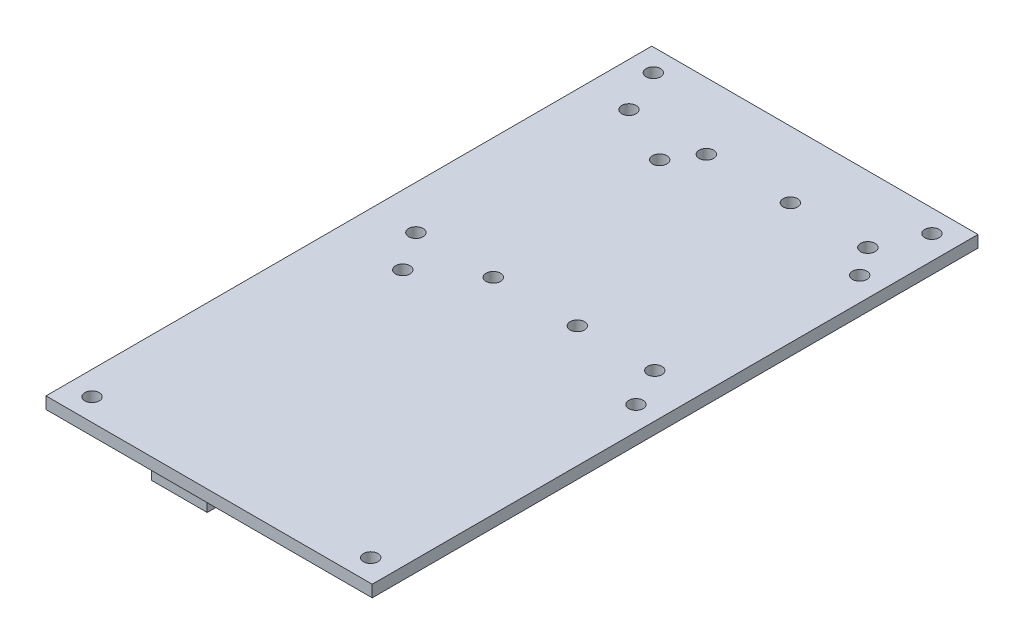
ISO-10303-21;
HEADER;
FILE_DESCRIPTION(('STEP AP214'),'2;1');
FILE_NAME('part.step','',(''),(''),'','','');
FILE_SCHEMA(('AUTOMOTIVE_DESIGN { 1 0 10303 214 1 1 1 1 }'));
ENDSEC;
DATA;
#1=APPLICATION_CONTEXT('core data for automotive mechanical design processes');
#2=APPLICATION_PROTOCOL_DEFINITION('international standard','automotive_design',2000,#1);
#3=PRODUCT_CONTEXT('',#1,'mechanical');
#4=PRODUCT('Part','Part','',(#3));
#5=PRODUCT_RELATED_PRODUCT_CATEGORY('part','',(#4));
#6=PRODUCT_DEFINITION_FORMATION('','',#4);
#7=PRODUCT_DEFINITION_CONTEXT('part definition',#1,'design');
#8=PRODUCT_DEFINITION('design','',#6,#7);
#9=PRODUCT_DEFINITION_SHAPE('','',#8);
#10=(LENGTH_UNIT() NAMED_UNIT(*) SI_UNIT(.MILLI.,.METRE.));
#11=(NAMED_UNIT(*) PLANE_ANGLE_UNIT() SI_UNIT($,.RADIAN.));
#12=(NAMED_UNIT(*) SI_UNIT($,.STERADIAN.) SOLID_ANGLE_UNIT());
#13=UNCERTAINTY_MEASURE_WITH_UNIT(LENGTH_MEASURE(1.E-05),#10,'distance_accuracy_value','');
#14=(GEOMETRIC_REPRESENTATION_CONTEXT(3) GLOBAL_UNCERTAINTY_ASSIGNED_CONTEXT((#13)) GLOBAL_UNIT_ASSIGNED_CONTEXT((#10,
#11,#12)) REPRESENTATION_CONTEXT('',''));
#15=CARTESIAN_POINT('',(0.,0.,0.));
#16=DIRECTION('',(0.,0.,1.));
#17=DIRECTION('',(1.,0.,0.));
#18=AXIS2_PLACEMENT_3D('',#15,#16,#17);
#19=CARTESIAN_POINT('',(0.,0.,0.));
#20=DIRECTION('',(0.,-1.,0.));
#21=DIRECTION('',(0.,0.,-1.));
#22=AXIS2_PLACEMENT_3D('',#19,#20,#21);
#23=PLANE('',#22);
#24=CARTESIAN_POINT('',(14.859,0.,-61.7062000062));
#25=DIRECTION('',(0.,1.,0.));
#26=DIRECTION('',(0.,0.,1.));
#27=AXIS2_PLACEMENT_3D('',#24,#25,#26);
#28=CIRCLE('',#27,1.5499969);
#29=CARTESIAN_POINT('',(14.859,0.,-60.1562031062));
#30=VERTEX_POINT('',#29);
#31=EDGE_CURVE('E220',#30,#30,#28,.T.);
#32=ORIENTED_EDGE('',*,*,#31,.T.);
#33=EDGE_LOOP('',(#32));
#34=FACE_BOUND('',#33,.T.);
#35=CARTESIAN_POINT('',(64.897,0.,-61.7062000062));
#36=DIRECTION('',(0.,1.,0.));
#37=DIRECTION('',(0.,0.,1.));
#38=AXIS2_PLACEMENT_3D('',#35,#36,#37);
#39=CIRCLE('',#38,1.5499969);
#40=CARTESIAN_POINT('',(64.897,0.,-60.1562031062));
#41=VERTEX_POINT('',#40);
#42=EDGE_CURVE('E212',#41,#41,#39,.T.);
#43=ORIENTED_EDGE('',*,*,#42,.T.);
#44=EDGE_LOOP('',(#43));
#45=FACE_BOUND('',#44,.T.);
#46=CARTESIAN_POINT('',(64.897,0.,-109.7122000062));
#47=DIRECTION('',(0.,1.,0.));
#48=DIRECTION('',(0.,0.,1.));
#49=AXIS2_PLACEMENT_3D('',#46,#47,#48);
#50=CIRCLE('',#49,1.5499969);
#51=CARTESIAN_POINT('',(64.897,0.,-108.1622031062));
#52=VERTEX_POINT('',#51);
#53=EDGE_CURVE('E203',#52,#52,#50,.T.);
#54=ORIENTED_EDGE('',*,*,#53,.T.);
#55=EDGE_LOOP('',(#54));
#56=FACE_BOUND('',#55,.T.);
#57=CARTESIAN_POINT('',(21.971,0.,-109.7122000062));
#58=DIRECTION('',(0.,1.,0.));
#59=DIRECTION('',(0.,0.,1.));
#60=AXIS2_PLACEMENT_3D('',#57,#58,#59);
#61=CIRCLE('',#60,1.5499969);
#62=CARTESIAN_POINT('',(21.971,0.,-108.1622031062));
#63=VERTEX_POINT('',#62);
#64=EDGE_CURVE('E227',#63,#63,#61,.T.);
#65=ORIENTED_EDGE('',*,*,#64,.T.);
#66=EDGE_LOOP('',(#65));
#67=FACE_BOUND('',#66,.T.);
#68=CARTESIAN_POINT('',(9.34800010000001,0.,-70.0281999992));
#69=DIRECTION('',(0.,1.,0.));
#70=DIRECTION('',(0.,0.,1.));
#71=AXIS2_PLACEMENT_3D('',#68,#69,#70);
#72=CIRCLE('',#71,1.54999689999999);
#73=CARTESIAN_POINT('',(9.34800010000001,0.,-68.4782030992));
#74=VERTEX_POINT('',#73);
#75=EDGE_CURVE('E259',#74,#74,#72,.T.);
#76=ORIENTED_EDGE('',*,*,#75,.T.);
#77=EDGE_LOOP('',(#76));
#78=FACE_BOUND('',#77,.T.);
#79=CARTESIAN_POINT('',(25.9596001,0.,-70.0281999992));
#80=DIRECTION('',(0.,1.,0.));
#81=DIRECTION('',(0.,0.,1.));
#82=AXIS2_PLACEMENT_3D('',#79,#80,#81);
#83=CIRCLE('',#82,1.5499969);
#84=CARTESIAN_POINT('',(25.9596001,0.,-68.4782030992));
#85=VERTEX_POINT('',#84);
#86=EDGE_CURVE('E268',#85,#85,#83,.T.);
#87=ORIENTED_EDGE('',*,*,#86,.T.);
#88=EDGE_LOOP('',(#87));
#89=FACE_BOUND('',#88,.T.);
#90=CARTESIAN_POINT('',(25.9596001,0.,-115.7481999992));
#91=DIRECTION('',(0.,1.,0.));
#92=DIRECTION('',(0.,0.,1.));
#93=AXIS2_PLACEMENT_3D('',#90,#91,#92);
#94=CIRCLE('',#93,1.5499969);
#95=CARTESIAN_POINT('',(25.9596001,0.,-114.1982030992));
#96=VERTEX_POINT('',#95);
#97=EDGE_CURVE('E276',#96,#96,#94,.T.);
#98=ORIENTED_EDGE('',*,*,#97,.T.);
#99=EDGE_LOOP('',(#98));
#100=FACE_BOUND('',#99,.T.);
#101=CARTESIAN_POINT('',(43.9928,0.,-115.7481999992));
#102=DIRECTION('',(0.,1.,0.));
#103=DIRECTION('',(0.,0.,1.));
#104=AXIS2_PLACEMENT_3D('',#101,#102,#103);
#105=CIRCLE('',#104,1.54999689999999);
#106=CARTESIAN_POINT('',(43.9928,0.,-114.1982030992));
#107=VERTEX_POINT('',#106);
#108=EDGE_CURVE('E284',#107,#107,#105,.T.);
#109=ORIENTED_EDGE('',*,*,#108,.T.);
#110=EDGE_LOOP('',(#109));
#111=FACE_BOUND('',#110,.T.);
#112=CARTESIAN_POINT('',(60.6044,0.,-115.7481999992));
#113=DIRECTION('',(0.,1.,0.));
#114=DIRECTION('',(0.,0.,1.));
#115=AXIS2_PLACEMENT_3D('',#112,#113,#114);
#116=CIRCLE('',#115,1.5499969);
#117=CARTESIAN_POINT('',(60.6044,0.,-114.1982030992));
#118=VERTEX_POINT('',#117);
#119=EDGE_CURVE('E235',#118,#118,#116,.T.);
#120=ORIENTED_EDGE('',*,*,#119,.T.);
#121=EDGE_LOOP('',(#120));
#122=FACE_BOUND('',#121,.T.);
#123=CARTESIAN_POINT('',(60.6044,0.,-70.0281999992));
#124=DIRECTION('',(0.,1.,0.));
#125=DIRECTION('',(0.,0.,1.));
#126=AXIS2_PLACEMENT_3D('',#123,#124,#125);
#127=CIRCLE('',#126,1.5499969);
#128=CARTESIAN_POINT('',(60.6044,0.,-68.4782030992));
#129=VERTEX_POINT('',#128);
#130=EDGE_CURVE('E244',#129,#129,#127,.T.);
#131=ORIENTED_EDGE('',*,*,#130,.T.);
#132=EDGE_LOOP('',(#131));
#133=FACE_BOUND('',#132,.T.);
#134=CARTESIAN_POINT('',(43.9928,0.,-70.0281999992));
#135=DIRECTION('',(0.,1.,0.));
#136=DIRECTION('',(0.,0.,1.));
#137=AXIS2_PLACEMENT_3D('',#134,#135,#136);
#138=CIRCLE('',#137,1.54999689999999);
#139=CARTESIAN_POINT('',(43.9928,0.,-68.4782030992));
#140=VERTEX_POINT('',#139);
#141=EDGE_CURVE('E252',#140,#140,#138,.T.);
#142=ORIENTED_EDGE('',*,*,#141,.T.);
#143=EDGE_LOOP('',(#142));
#144=FACE_BOUND('',#143,.T.);
#145=CARTESIAN_POINT('',(9.3480001,0.,-115.7481999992));
#146=DIRECTION('',(0.,1.,0.));
#147=DIRECTION('',(0.,0.,1.));
#148=AXIS2_PLACEMENT_3D('',#145,#146,#147);
#149=CIRCLE('',#148,1.54999689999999);
#150=CARTESIAN_POINT('',(9.3480001,0.,-114.1982030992));
#151=VERTEX_POINT('',#150);
#152=EDGE_CURVE('E291',#151,#151,#149,.T.);
#153=ORIENTED_EDGE('',*,*,#152,.T.);
#154=EDGE_LOOP('',(#153));
#155=FACE_BOUND('',#154,.T.);
#156=CARTESIAN_POINT('',(5.1054,0.,-4.7752));
#157=DIRECTION('',(0.,1.,0.));
#158=DIRECTION('',(0.,0.,1.));
#159=AXIS2_PLACEMENT_3D('',#156,#157,#158);
#160=CIRCLE('',#159,1.5499969);
#161=CARTESIAN_POINT('',(5.1054,0.,-3.2252031));
#162=VERTEX_POINT('',#161);
#163=EDGE_CURVE('E316',#162,#162,#160,.T.);
#164=ORIENTED_EDGE('',*,*,#163,.T.);
#165=EDGE_LOOP('',(#164));
#166=FACE_BOUND('',#165,.T.);
#167=CARTESIAN_POINT('',(64.897,0.,-4.7752));
#168=DIRECTION('',(0.,1.,0.));
#169=DIRECTION('',(0.,0.,1.));
#170=AXIS2_PLACEMENT_3D('',#167,#168,#169);
#171=CIRCLE('',#170,1.5499969);
#172=CARTESIAN_POINT('',(64.897,0.,-3.2252031));
#173=VERTEX_POINT('',#172);
#174=EDGE_CURVE('E308',#173,#173,#171,.T.);
#175=ORIENTED_EDGE('',*,*,#174,.T.);
#176=EDGE_LOOP('',(#175));
#177=FACE_BOUND('',#176,.T.);
#178=CARTESIAN_POINT('',(64.897,0.,-125.222));
#179=DIRECTION('',(0.,1.,0.));
#180=DIRECTION('',(0.,0.,1.));
#181=AXIS2_PLACEMENT_3D('',#178,#179,#180);
#182=CIRCLE('',#181,1.54999690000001);
#183=CARTESIAN_POINT('',(64.897,0.,-123.6720031));
#184=VERTEX_POINT('',#183);
#185=EDGE_CURVE('E299',#184,#184,#182,.T.);
#186=ORIENTED_EDGE('',*,*,#185,.T.);
#187=EDGE_LOOP('',(#186));
#188=FACE_BOUND('',#187,.T.);
#189=CARTESIAN_POINT('',(5.10539999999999,0.,-125.222));
#190=DIRECTION('',(0.,1.,0.));
#191=DIRECTION('',(0.,0.,1.));
#192=AXIS2_PLACEMENT_3D('',#189,#190,#191);
#193=CIRCLE('',#192,1.5499969);
#194=CARTESIAN_POINT('',(5.10539999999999,0.,-123.6720031));
#195=VERTEX_POINT('',#194);
#196=EDGE_CURVE('E323',#195,#195,#193,.T.);
#197=ORIENTED_EDGE('',*,*,#196,.T.);
#198=EDGE_LOOP('',(#197));
#199=FACE_BOUND('',#198,.T.);
#200=DIRECTION('',(0.,0.,1.));
#201=VECTOR('',#200,1.);
#202=CARTESIAN_POINT('',(0.,0.,0.));
#203=LINE('',#202,#201);
#204=CARTESIAN_POINT('',(0.,0.,-129.9972));
#205=VERTEX_POINT('',#204);
#206=CARTESIAN_POINT('',(0.,0.,0.));
#207=VERTEX_POINT('',#206);
#208=EDGE_CURVE('E327',#205,#207,#203,.T.);
#209=ORIENTED_EDGE('',*,*,#208,.F.);
#210=DIRECTION('',(-1.,0.,0.));
#211=VECTOR('',#210,1.);
#212=CARTESIAN_POINT('',(0.,0.,-129.9972));
#213=LINE('',#212,#211);
#214=CARTESIAN_POINT('',(70.0024,0.,-129.9972));
#215=VERTEX_POINT('',#214);
#216=EDGE_CURVE('E336',#215,#205,#213,.T.);
#217=ORIENTED_EDGE('',*,*,#216,.F.);
#218=DIRECTION('',(0.,0.,-1.));
#219=VECTOR('',#218,1.);
#220=CARTESIAN_POINT('',(70.0024,0.,0.));
#221=LINE('',#220,#219);
#222=CARTESIAN_POINT('',(70.0024,0.,0.));
#223=VERTEX_POINT('',#222);
#224=EDGE_CURVE('E352',#223,#215,#221,.T.);
#225=ORIENTED_EDGE('',*,*,#224,.F.);
#226=DIRECTION('',(1.,0.,0.));
#227=VECTOR('',#226,1.);
#228=CARTESIAN_POINT('',(0.,0.,0.));
#229=LINE('',#228,#227);
#230=EDGE_CURVE('E349',#207,#223,#229,.T.);
#231=ORIENTED_EDGE('',*,*,#230,.F.);
#232=EDGE_LOOP('',(#209,#217,#225,#231));
#233=FACE_BOUND('',#232,.T.);
#234=DIRECTION('',(1.,0.,0.));
#235=VECTOR('',#234,1.);
#236=CARTESIAN_POINT('',(18.4380000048,0.,-18.209999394));
#237=LINE('',#236,#235);
#238=CARTESIAN_POINT('',(18.4380000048,0.,-18.209999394));
#239=VERTEX_POINT('',#238);
#240=CARTESIAN_POINT('',(30.4380014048,0.,-18.209999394));
#241=VERTEX_POINT('',#240);
#242=EDGE_CURVE('E163',#239,#241,#237,.T.);
#243=ORIENTED_EDGE('',*,*,#242,.F.);
#244=DIRECTION('',(0.,0.,-1.));
#245=VECTOR('',#244,1.);
#246=CARTESIAN_POINT('',(18.4380000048,0.,-4.1599993));
#247=LINE('',#246,#245);
#248=CARTESIAN_POINT('',(18.4380000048,0.,-4.1599993));
#249=VERTEX_POINT('',#248);
#250=EDGE_CURVE('E158',#249,#239,#247,.T.);
#251=ORIENTED_EDGE('',*,*,#250,.F.);
#252=DIRECTION('',(-1.,0.,0.));
#253=VECTOR('',#252,1.);
#254=CARTESIAN_POINT('',(18.4380000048,0.,-4.1599993));
#255=LINE('',#254,#253);
#256=CARTESIAN_POINT('',(30.4380014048,0.,-4.1599993));
#257=VERTEX_POINT('',#256);
#258=EDGE_CURVE('E173',#257,#249,#255,.T.);
#259=ORIENTED_EDGE('',*,*,#258,.F.);
#260=DIRECTION('',(0.,0.,1.));
#261=VECTOR('',#260,1.);
#262=CARTESIAN_POINT('',(30.4380014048,0.,-4.1599993));
#263=LINE('',#262,#261);
#264=EDGE_CURVE('E185',#241,#257,#263,.T.);
#265=ORIENTED_EDGE('',*,*,#264,.F.);
#266=EDGE_LOOP('',(#243,#251,#259,#265));
#267=FACE_BOUND('',#266,.T.);
#268=DIRECTION('',(1.,0.,0.));
#269=VECTOR('',#268,1.);
#270=CARTESIAN_POINT('',(28.956,0.,-127.9692000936));
#271=LINE('',#270,#269);
#272=CARTESIAN_POINT('',(28.956,0.,-127.9692000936));
#273=VERTEX_POINT('',#272);
#274=CARTESIAN_POINT('',(40.9560014,0.,-127.9692000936));
#275=VERTEX_POINT('',#274);
#276=EDGE_CURVE('E754',#273,#275,#271,.T.);
#277=ORIENTED_EDGE('',*,*,#276,.F.);
#278=DIRECTION('',(0.,0.,-1.));
#279=VECTOR('',#278,1.);
#280=CARTESIAN_POINT('',(28.956,0.,-113.9191999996));
#281=LINE('',#280,#279);
#282=CARTESIAN_POINT('',(28.956,0.,-113.9191999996));
#283=VERTEX_POINT('',#282);
#284=EDGE_CURVE('E155',#283,#273,#281,.T.);
#285=ORIENTED_EDGE('',*,*,#284,.F.);
#286=DIRECTION('',(-1.,0.,0.));
#287=VECTOR('',#286,1.);
#288=CARTESIAN_POINT('',(28.956,0.,-113.9191999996));
#289=LINE('',#288,#287);
#290=CARTESIAN_POINT('',(40.9560014,0.,-113.9191999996));
#291=VERTEX_POINT('',#290);
#292=EDGE_CURVE('E151',#291,#283,#289,.T.);
#293=ORIENTED_EDGE('',*,*,#292,.F.);
#294=DIRECTION('',(0.,0.,1.));
#295=VECTOR('',#294,1.);
#296=CARTESIAN_POINT('',(40.9560014,0.,-113.9191999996));
#297=LINE('',#296,#295);
#298=EDGE_CURVE('E750',#275,#291,#297,.T.);
#299=ORIENTED_EDGE('',*,*,#298,.F.);
#300=EDGE_LOOP('',(#277,#285,#293,#299));
#301=FACE_BOUND('',#300,.T.);
#302=ADVANCED_FACE('F39',(#34,#45,#56,#67,#78,#89,#100,#111,#122,#133,#144,#155,#166,#177,#188,
#199,#233,#267,#301),#23,.T.);
#303=CARTESIAN_POINT('',(0.,2.54,0.));
#304=DIRECTION('',(1.,0.,0.));
#305=DIRECTION('',(0.,0.,-1.));
#306=AXIS2_PLACEMENT_3D('',#303,#304,#305);
#307=PLANE('',#306);
#308=ORIENTED_EDGE('',*,*,#208,.T.);
#309=DIRECTION('',(0.,-1.,0.));
#310=VECTOR('',#309,1.);
#311=CARTESIAN_POINT('',(0.,2.54,0.));
#312=LINE('',#311,#310);
#313=CARTESIAN_POINT('',(0.,2.54,0.));
#314=VERTEX_POINT('',#313);
#315=EDGE_CURVE('E11',#314,#207,#312,.T.);
#316=ORIENTED_EDGE('',*,*,#315,.F.);
#317=DIRECTION('',(0.,0.,1.));
#318=VECTOR('',#317,1.);
#319=CARTESIAN_POINT('',(0.,2.54,0.));
#320=LINE('',#319,#318);
#321=CARTESIAN_POINT('',(0.,2.54,-129.9972));
#322=VERTEX_POINT('',#321);
#323=EDGE_CURVE('E331',#322,#314,#320,.T.);
#324=ORIENTED_EDGE('',*,*,#323,.F.);
#325=DIRECTION('',(0.,-1.,0.));
#326=VECTOR('',#325,1.);
#327=CARTESIAN_POINT('',(0.,2.54,-129.9972));
#328=LINE('',#327,#326);
#329=EDGE_CURVE('E345',#322,#205,#328,.T.);
#330=ORIENTED_EDGE('',*,*,#329,.T.);
#331=EDGE_LOOP('',(#308,#316,#324,#330));
#332=FACE_BOUND('',#331,.T.);
#333=ADVANCED_FACE('F41',(#332),#307,.F.);
#334=CARTESIAN_POINT('',(0.,2.54,0.));
#335=DIRECTION('',(0.,0.,-1.));
#336=DIRECTION('',(-1.,0.,0.));
#337=AXIS2_PLACEMENT_3D('',#334,#335,#336);
#338=PLANE('',#337);
#339=ORIENTED_EDGE('',*,*,#230,.T.);
#340=DIRECTION('',(0.,-1.,0.));
#341=VECTOR('',#340,1.);
#342=CARTESIAN_POINT('',(70.0024,2.54,0.));
#343=LINE('',#342,#341);
#344=CARTESIAN_POINT('',(70.0024,2.54,0.));
#345=VERTEX_POINT('',#344);
#346=EDGE_CURVE('E48',#345,#223,#343,.T.);
#347=ORIENTED_EDGE('',*,*,#346,.F.);
#348=DIRECTION('',(1.,0.,0.));
#349=VECTOR('',#348,1.);
#350=CARTESIAN_POINT('',(0.,2.54,0.));
#351=LINE('',#350,#349);
#352=EDGE_CURVE('E335',#314,#345,#351,.T.);
#353=ORIENTED_EDGE('',*,*,#352,.F.);
#354=ORIENTED_EDGE('',*,*,#315,.T.);
#355=EDGE_LOOP('',(#339,#347,#353,#354));
#356=FACE_BOUND('',#355,.T.);
#357=ADVANCED_FACE('F385',(#356),#338,.F.);
#358=CARTESIAN_POINT('',(70.0024,2.54,0.));
#359=DIRECTION('',(-1.,0.,0.));
#360=DIRECTION('',(0.,0.,1.));
#361=AXIS2_PLACEMENT_3D('',#358,#359,#360);
#362=PLANE('',#361);
#363=ORIENTED_EDGE('',*,*,#224,.T.);
#364=DIRECTION('',(0.,-1.,0.));
#365=VECTOR('',#364,1.);
#366=CARTESIAN_POINT('',(70.0024,2.54,-129.9972));
#367=LINE('',#366,#365);
#368=CARTESIAN_POINT('',(70.0024,2.54,-129.9972));
#369=VERTEX_POINT('',#368);
#370=EDGE_CURVE('E360',#369,#215,#367,.T.);
#371=ORIENTED_EDGE('',*,*,#370,.F.);
#372=DIRECTION('',(0.,0.,-1.));
#373=VECTOR('',#372,1.);
#374=CARTESIAN_POINT('',(70.0024,2.54,0.));
#375=LINE('',#374,#373);
#376=EDGE_CURVE('E339',#345,#369,#375,.T.);
#377=ORIENTED_EDGE('',*,*,#376,.F.);
#378=ORIENTED_EDGE('',*,*,#346,.T.);
#379=EDGE_LOOP('',(#363,#371,#377,#378));
#380=FACE_BOUND('',#379,.T.);
#381=ADVANCED_FACE('F369',(#380),#362,.F.);
#382=CARTESIAN_POINT('',(0.,2.54,-129.9972));
#383=DIRECTION('',(0.,0.,1.));
#384=DIRECTION('',(1.,0.,0.));
#385=AXIS2_PLACEMENT_3D('',#382,#383,#384);
#386=PLANE('',#385);
#387=ORIENTED_EDGE('',*,*,#216,.T.);
#388=ORIENTED_EDGE('',*,*,#329,.F.);
#389=DIRECTION('',(-1.,0.,0.));
#390=VECTOR('',#389,1.);
#391=CARTESIAN_POINT('',(0.,2.54,-129.9972));
#392=LINE('',#391,#390);
#393=EDGE_CURVE('E342',#369,#322,#392,.T.);
#394=ORIENTED_EDGE('',*,*,#393,.F.);
#395=ORIENTED_EDGE('',*,*,#370,.T.);
#396=EDGE_LOOP('',(#387,#388,#394,#395));
#397=FACE_BOUND('',#396,.T.);
#398=ADVANCED_FACE('F378',(#397),#386,.F.);
#399=CARTESIAN_POINT('',(0.,2.54,0.));
#400=DIRECTION('',(0.,-1.,0.));
#401=DIRECTION('',(0.,0.,-1.));
#402=AXIS2_PLACEMENT_3D('',#399,#400,#401);
#403=PLANE('',#402);
#404=CARTESIAN_POINT('',(14.859,2.54,-61.7062000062));
#405=DIRECTION('',(0.,1.,0.));
#406=DIRECTION('',(0.,0.,1.));
#407=AXIS2_PLACEMENT_3D('',#404,#405,#406);
#408=CIRCLE('',#407,1.5499969);
#409=CARTESIAN_POINT('',(14.859,2.54,-60.1562031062));
#410=VERTEX_POINT('',#409);
#411=EDGE_CURVE('E202',#410,#410,#408,.T.);
#412=ORIENTED_EDGE('',*,*,#411,.F.);
#413=EDGE_LOOP('',(#412));
#414=FACE_BOUND('',#413,.T.);
#415=CARTESIAN_POINT('',(64.897,2.54,-61.7062000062));
#416=DIRECTION('',(0.,1.,0.));
#417=DIRECTION('',(0.,0.,1.));
#418=AXIS2_PLACEMENT_3D('',#415,#416,#417);
#419=CIRCLE('',#418,1.5499969);
#420=CARTESIAN_POINT('',(64.897,2.54,-60.1562031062));
#421=VERTEX_POINT('',#420);
#422=EDGE_CURVE('E216',#421,#421,#419,.T.);
#423=ORIENTED_EDGE('',*,*,#422,.F.);
#424=EDGE_LOOP('',(#423));
#425=FACE_BOUND('',#424,.T.);
#426=CARTESIAN_POINT('',(64.897,2.54,-109.7122000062));
#427=DIRECTION('',(0.,1.,0.));
#428=DIRECTION('',(0.,0.,1.));
#429=AXIS2_PLACEMENT_3D('',#426,#427,#428);
#430=CIRCLE('',#429,1.5499969);
#431=CARTESIAN_POINT('',(64.897,2.54,-108.1622031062));
#432=VERTEX_POINT('',#431);
#433=EDGE_CURVE('E208',#432,#432,#430,.T.);
#434=ORIENTED_EDGE('',*,*,#433,.F.);
#435=EDGE_LOOP('',(#434));
#436=FACE_BOUND('',#435,.T.);
#437=CARTESIAN_POINT('',(21.971,2.54,-109.7122000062));
#438=DIRECTION('',(0.,1.,0.));
#439=DIRECTION('',(0.,0.,1.));
#440=AXIS2_PLACEMENT_3D('',#437,#438,#439);
#441=CIRCLE('',#440,1.5499969);
#442=CARTESIAN_POINT('',(21.971,2.54,-108.1622031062));
#443=VERTEX_POINT('',#442);
#444=EDGE_CURVE('E207',#443,#443,#441,.T.);
#445=ORIENTED_EDGE('',*,*,#444,.F.);
#446=EDGE_LOOP('',(#445));
#447=FACE_BOUND('',#446,.T.);
#448=CARTESIAN_POINT('',(9.34800010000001,2.54,-70.0281999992));
#449=DIRECTION('',(0.,1.,0.));
#450=DIRECTION('',(0.,0.,1.));
#451=AXIS2_PLACEMENT_3D('',#448,#449,#450);
#452=CIRCLE('',#451,1.54999689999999);
#453=CARTESIAN_POINT('',(9.34800010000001,2.54,-68.4782030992));
#454=VERTEX_POINT('',#453);
#455=EDGE_CURVE('E264',#454,#454,#452,.T.);
#456=ORIENTED_EDGE('',*,*,#455,.F.);
#457=EDGE_LOOP('',(#456));
#458=FACE_BOUND('',#457,.T.);
#459=CARTESIAN_POINT('',(25.9596001,2.54,-70.0281999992));
#460=DIRECTION('',(0.,1.,0.));
#461=DIRECTION('',(0.,0.,1.));
#462=AXIS2_PLACEMENT_3D('',#459,#460,#461);
#463=CIRCLE('',#462,1.5499969);
#464=CARTESIAN_POINT('',(25.9596001,2.54,-68.4782030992));
#465=VERTEX_POINT('',#464);
#466=EDGE_CURVE('E272',#465,#465,#463,.T.);
#467=ORIENTED_EDGE('',*,*,#466,.F.);
#468=EDGE_LOOP('',(#467));
#469=FACE_BOUND('',#468,.T.);
#470=CARTESIAN_POINT('',(25.9596001,2.54,-115.7481999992));
#471=DIRECTION('',(0.,1.,0.));
#472=DIRECTION('',(0.,0.,1.));
#473=AXIS2_PLACEMENT_3D('',#470,#471,#472);
#474=CIRCLE('',#473,1.5499969);
#475=CARTESIAN_POINT('',(25.9596001,2.54,-114.1982030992));
#476=VERTEX_POINT('',#475);
#477=EDGE_CURVE('E280',#476,#476,#474,.T.);
#478=ORIENTED_EDGE('',*,*,#477,.F.);
#479=EDGE_LOOP('',(#478));
#480=FACE_BOUND('',#479,.T.);
#481=CARTESIAN_POINT('',(43.9928,2.54,-115.7481999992));
#482=DIRECTION('',(0.,1.,0.));
#483=DIRECTION('',(0.,0.,1.));
#484=AXIS2_PLACEMENT_3D('',#481,#482,#483);
#485=CIRCLE('',#484,1.54999689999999);
#486=CARTESIAN_POINT('',(43.9928,2.54,-114.1982030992));
#487=VERTEX_POINT('',#486);
#488=EDGE_CURVE('E239',#487,#487,#485,.T.);
#489=ORIENTED_EDGE('',*,*,#488,.F.);
#490=EDGE_LOOP('',(#489));
#491=FACE_BOUND('',#490,.T.);
#492=CARTESIAN_POINT('',(60.6044,2.54,-115.7481999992));
#493=DIRECTION('',(0.,1.,0.));
#494=DIRECTION('',(0.,0.,1.));
#495=AXIS2_PLACEMENT_3D('',#492,#493,#494);
#496=CIRCLE('',#495,1.5499969);
#497=CARTESIAN_POINT('',(60.6044,2.54,-114.1982030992));
#498=VERTEX_POINT('',#497);
#499=EDGE_CURVE('E240',#498,#498,#496,.T.);
#500=ORIENTED_EDGE('',*,*,#499,.F.);
#501=EDGE_LOOP('',(#500));
#502=FACE_BOUND('',#501,.T.);
#503=CARTESIAN_POINT('',(60.6044,2.54,-70.0281999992));
#504=DIRECTION('',(0.,1.,0.));
#505=DIRECTION('',(0.,0.,1.));
#506=AXIS2_PLACEMENT_3D('',#503,#504,#505);
#507=CIRCLE('',#506,1.5499969);
#508=CARTESIAN_POINT('',(60.6044,2.54,-68.4782030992));
#509=VERTEX_POINT('',#508);
#510=EDGE_CURVE('E248',#509,#509,#507,.T.);
#511=ORIENTED_EDGE('',*,*,#510,.F.);
#512=EDGE_LOOP('',(#511));
#513=FACE_BOUND('',#512,.T.);
#514=CARTESIAN_POINT('',(43.9928,2.54,-70.0281999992));
#515=DIRECTION('',(0.,1.,0.));
#516=DIRECTION('',(0.,0.,1.));
#517=AXIS2_PLACEMENT_3D('',#514,#515,#516);
#518=CIRCLE('',#517,1.54999689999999);
#519=CARTESIAN_POINT('',(43.9928,2.54,-68.4782030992));
#520=VERTEX_POINT('',#519);
#521=EDGE_CURVE('E231',#520,#520,#518,.T.);
#522=ORIENTED_EDGE('',*,*,#521,.F.);
#523=EDGE_LOOP('',(#522));
#524=FACE_BOUND('',#523,.T.);
#525=CARTESIAN_POINT('',(9.3480001,2.54,-115.7481999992));
#526=DIRECTION('',(0.,1.,0.));
#527=DIRECTION('',(0.,0.,1.));
#528=AXIS2_PLACEMENT_3D('',#525,#526,#527);
#529=CIRCLE('',#528,1.54999689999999);
#530=CARTESIAN_POINT('',(9.3480001,2.54,-114.1982030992));
#531=VERTEX_POINT('',#530);
#532=EDGE_CURVE('E263',#531,#531,#529,.T.);
#533=ORIENTED_EDGE('',*,*,#532,.F.);
#534=EDGE_LOOP('',(#533));
#535=FACE_BOUND('',#534,.T.);
#536=CARTESIAN_POINT('',(5.1054,2.54,-4.7752));
#537=DIRECTION('',(0.,1.,0.));
#538=DIRECTION('',(0.,0.,1.));
#539=AXIS2_PLACEMENT_3D('',#536,#537,#538);
#540=CIRCLE('',#539,1.5499969);
#541=CARTESIAN_POINT('',(5.1054,2.54,-3.2252031));
#542=VERTEX_POINT('',#541);
#543=EDGE_CURVE('E295',#542,#542,#540,.T.);
#544=ORIENTED_EDGE('',*,*,#543,.F.);
#545=EDGE_LOOP('',(#544));
#546=FACE_BOUND('',#545,.T.);
#547=CARTESIAN_POINT('',(64.897,2.54,-4.7752));
#548=DIRECTION('',(0.,1.,0.));
#549=DIRECTION('',(0.,0.,1.));
#550=AXIS2_PLACEMENT_3D('',#547,#548,#549);
#551=CIRCLE('',#550,1.5499969);
#552=CARTESIAN_POINT('',(64.897,2.54,-3.2252031));
#553=VERTEX_POINT('',#552);
#554=EDGE_CURVE('E312',#553,#553,#551,.T.);
#555=ORIENTED_EDGE('',*,*,#554,.F.);
#556=EDGE_LOOP('',(#555));
#557=FACE_BOUND('',#556,.T.);
#558=CARTESIAN_POINT('',(64.897,2.54,-125.222));
#559=DIRECTION('',(0.,1.,0.));
#560=DIRECTION('',(0.,0.,1.));
#561=AXIS2_PLACEMENT_3D('',#558,#559,#560);
#562=CIRCLE('',#561,1.54999690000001);
#563=CARTESIAN_POINT('',(64.897,2.54,-123.6720031));
#564=VERTEX_POINT('',#563);
#565=EDGE_CURVE('E304',#564,#564,#562,.T.);
#566=ORIENTED_EDGE('',*,*,#565,.F.);
#567=EDGE_LOOP('',(#566));
#568=FACE_BOUND('',#567,.T.);
#569=CARTESIAN_POINT('',(5.10539999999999,2.54,-125.222));
#570=DIRECTION('',(0.,1.,0.));
#571=DIRECTION('',(0.,0.,1.));
#572=AXIS2_PLACEMENT_3D('',#569,#570,#571);
#573=CIRCLE('',#572,1.5499969);
#574=CARTESIAN_POINT('',(5.10539999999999,2.54,-123.6720031));
#575=VERTEX_POINT('',#574);
#576=EDGE_CURVE('E303',#575,#575,#573,.T.);
#577=ORIENTED_EDGE('',*,*,#576,.F.);
#578=EDGE_LOOP('',(#577));
#579=FACE_BOUND('',#578,.T.);
#580=ORIENTED_EDGE('',*,*,#323,.T.);
#581=ORIENTED_EDGE('',*,*,#352,.T.);
#582=ORIENTED_EDGE('',*,*,#376,.T.);
#583=ORIENTED_EDGE('',*,*,#393,.T.);
#584=EDGE_LOOP('',(#580,#581,#582,#583));
#585=FACE_BOUND('',#584,.T.);
#586=ADVANCED_FACE('F384',(#414,#425,#436,#447,#458,#469,#480,#491,#502,#513,#524,#535,#546,
#557,#568,#579,#585),#403,.F.);
#587=CARTESIAN_POINT('',(5.10539999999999,0.,-125.222));
#588=DIRECTION('',(0.,1.,0.));
#589=DIRECTION('',(0.,0.,1.));
#590=AXIS2_PLACEMENT_3D('',#587,#588,#589);
#591=CYLINDRICAL_SURFACE('',#590,1.5499969);
#592=ORIENTED_EDGE('',*,*,#196,.F.);
#593=EDGE_LOOP('',(#592));
#594=FACE_BOUND('',#593,.T.);
#595=ORIENTED_EDGE('',*,*,#576,.T.);
#596=EDGE_LOOP('',(#595));
#597=FACE_BOUND('',#596,.T.);
#598=ADVANCED_FACE('F405',(#594,#597),#591,.F.);
#599=CARTESIAN_POINT('',(64.897,0.,-125.222));
#600=DIRECTION('',(0.,1.,0.));
#601=DIRECTION('',(0.,0.,1.));
#602=AXIS2_PLACEMENT_3D('',#599,#600,#601);
#603=CYLINDRICAL_SURFACE('',#602,1.54999690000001);
#604=ORIENTED_EDGE('',*,*,#185,.F.);
#605=EDGE_LOOP('',(#604));
#606=FACE_BOUND('',#605,.T.);
#607=ORIENTED_EDGE('',*,*,#565,.T.);
#608=EDGE_LOOP('',(#607));
#609=FACE_BOUND('',#608,.T.);
#610=ADVANCED_FACE('F410',(#606,#609),#603,.F.);
#611=CARTESIAN_POINT('',(64.897,0.,-4.7752));
#612=DIRECTION('',(0.,1.,0.));
#613=DIRECTION('',(0.,0.,1.));
#614=AXIS2_PLACEMENT_3D('',#611,#612,#613);
#615=CYLINDRICAL_SURFACE('',#614,1.5499969);
#616=ORIENTED_EDGE('',*,*,#174,.F.);
#617=EDGE_LOOP('',(#616));
#618=FACE_BOUND('',#617,.T.);
#619=ORIENTED_EDGE('',*,*,#554,.T.);
#620=EDGE_LOOP('',(#619));
#621=FACE_BOUND('',#620,.T.);
#622=ADVANCED_FACE('F446',(#618,#621),#615,.F.);
#623=CARTESIAN_POINT('',(5.1054,0.,-4.7752));
#624=DIRECTION('',(0.,1.,0.));
#625=DIRECTION('',(0.,0.,1.));
#626=AXIS2_PLACEMENT_3D('',#623,#624,#625);
#627=CYLINDRICAL_SURFACE('',#626,1.5499969);
#628=ORIENTED_EDGE('',*,*,#163,.F.);
#629=EDGE_LOOP('',(#628));
#630=FACE_BOUND('',#629,.T.);
#631=ORIENTED_EDGE('',*,*,#543,.T.);
#632=EDGE_LOOP('',(#631));
#633=FACE_BOUND('',#632,.T.);
#634=ADVANCED_FACE('F452',(#630,#633),#627,.F.);
#635=CARTESIAN_POINT('',(9.3480001,0.,-115.7481999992));
#636=DIRECTION('',(0.,1.,0.));
#637=DIRECTION('',(0.,0.,1.));
#638=AXIS2_PLACEMENT_3D('',#635,#636,#637);
#639=CYLINDRICAL_SURFACE('',#638,1.54999689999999);
#640=ORIENTED_EDGE('',*,*,#152,.F.);
#641=EDGE_LOOP('',(#640));
#642=FACE_BOUND('',#641,.T.);
#643=ORIENTED_EDGE('',*,*,#532,.T.);
#644=EDGE_LOOP('',(#643));
#645=FACE_BOUND('',#644,.T.);
#646=ADVANCED_FACE('F457',(#642,#645),#639,.F.);
#647=CARTESIAN_POINT('',(43.9928,0.,-70.0281999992));
#648=DIRECTION('',(0.,1.,0.));
#649=DIRECTION('',(0.,0.,1.));
#650=AXIS2_PLACEMENT_3D('',#647,#648,#649);
#651=CYLINDRICAL_SURFACE('',#650,1.54999689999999);
#652=ORIENTED_EDGE('',*,*,#141,.F.);
#653=EDGE_LOOP('',(#652));
#654=FACE_BOUND('',#653,.T.);
#655=ORIENTED_EDGE('',*,*,#521,.T.);
#656=EDGE_LOOP('',(#655));
#657=FACE_BOUND('',#656,.T.);
#658=ADVANCED_FACE('F465',(#654,#657),#651,.F.);
#659=CARTESIAN_POINT('',(60.6044,0.,-70.0281999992));
#660=DIRECTION('',(0.,1.,0.));
#661=DIRECTION('',(0.,0.,1.));
#662=AXIS2_PLACEMENT_3D('',#659,#660,#661);
#663=CYLINDRICAL_SURFACE('',#662,1.5499969);
#664=ORIENTED_EDGE('',*,*,#130,.F.);
#665=EDGE_LOOP('',(#664));
#666=FACE_BOUND('',#665,.T.);
#667=ORIENTED_EDGE('',*,*,#510,.T.);
#668=EDGE_LOOP('',(#667));
#669=FACE_BOUND('',#668,.T.);
#670=ADVANCED_FACE('F479',(#666,#669),#663,.F.);
#671=CARTESIAN_POINT('',(60.6044,0.,-115.7481999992));
#672=DIRECTION('',(0.,1.,0.));
#673=DIRECTION('',(0.,0.,1.));
#674=AXIS2_PLACEMENT_3D('',#671,#672,#673);
#675=CYLINDRICAL_SURFACE('',#674,1.5499969);
#676=ORIENTED_EDGE('',*,*,#119,.F.);
#677=EDGE_LOOP('',(#676));
#678=FACE_BOUND('',#677,.T.);
#679=ORIENTED_EDGE('',*,*,#499,.T.);
#680=EDGE_LOOP('',(#679));
#681=FACE_BOUND('',#680,.T.);
#682=ADVANCED_FACE('F488',(#678,#681),#675,.F.);
#683=CARTESIAN_POINT('',(43.9928,0.,-115.7481999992));
#684=DIRECTION('',(0.,1.,0.));
#685=DIRECTION('',(0.,0.,1.));
#686=AXIS2_PLACEMENT_3D('',#683,#684,#685);
#687=CYLINDRICAL_SURFACE('',#686,1.54999689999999);
#688=ORIENTED_EDGE('',*,*,#108,.F.);
#689=EDGE_LOOP('',(#688));
#690=FACE_BOUND('',#689,.T.);
#691=ORIENTED_EDGE('',*,*,#488,.T.);
#692=EDGE_LOOP('',(#691));
#693=FACE_BOUND('',#692,.T.);
#694=ADVANCED_FACE('F506',(#690,#693),#687,.F.);
#695=CARTESIAN_POINT('',(25.9596001,0.,-115.7481999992));
#696=DIRECTION('',(0.,1.,0.));
#697=DIRECTION('',(0.,0.,1.));
#698=AXIS2_PLACEMENT_3D('',#695,#696,#697);
#699=CYLINDRICAL_SURFACE('',#698,1.5499969);
#700=ORIENTED_EDGE('',*,*,#97,.F.);
#701=EDGE_LOOP('',(#700));
#702=FACE_BOUND('',#701,.T.);
#703=ORIENTED_EDGE('',*,*,#477,.T.);
#704=EDGE_LOOP('',(#703));
#705=FACE_BOUND('',#704,.T.);
#706=ADVANCED_FACE('F503',(#702,#705),#699,.F.);
#707=CARTESIAN_POINT('',(25.9596001,0.,-70.0281999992));
#708=DIRECTION('',(0.,1.,0.));
#709=DIRECTION('',(0.,0.,1.));
#710=AXIS2_PLACEMENT_3D('',#707,#708,#709);
#711=CYLINDRICAL_SURFACE('',#710,1.5499969);
#712=ORIENTED_EDGE('',*,*,#86,.F.);
#713=EDGE_LOOP('',(#712));
#714=FACE_BOUND('',#713,.T.);
#715=ORIENTED_EDGE('',*,*,#466,.T.);
#716=EDGE_LOOP('',(#715));
#717=FACE_BOUND('',#716,.T.);
#718=ADVANCED_FACE('F499',(#714,#717),#711,.F.);
#719=CARTESIAN_POINT('',(9.34800010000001,0.,-70.0281999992));
#720=DIRECTION('',(0.,1.,0.));
#721=DIRECTION('',(0.,0.,1.));
#722=AXIS2_PLACEMENT_3D('',#719,#720,#721);
#723=CYLINDRICAL_SURFACE('',#722,1.54999689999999);
#724=ORIENTED_EDGE('',*,*,#75,.F.);
#725=EDGE_LOOP('',(#724));
#726=FACE_BOUND('',#725,.T.);
#727=ORIENTED_EDGE('',*,*,#455,.T.);
#728=EDGE_LOOP('',(#727));
#729=FACE_BOUND('',#728,.T.);
#730=ADVANCED_FACE('F495',(#726,#729),#723,.F.);
#731=CARTESIAN_POINT('',(21.971,0.,-109.7122000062));
#732=DIRECTION('',(0.,1.,0.));
#733=DIRECTION('',(0.,0.,1.));
#734=AXIS2_PLACEMENT_3D('',#731,#732,#733);
#735=CYLINDRICAL_SURFACE('',#734,1.5499969);
#736=ORIENTED_EDGE('',*,*,#64,.F.);
#737=EDGE_LOOP('',(#736));
#738=FACE_BOUND('',#737,.T.);
#739=ORIENTED_EDGE('',*,*,#444,.T.);
#740=EDGE_LOOP('',(#739));
#741=FACE_BOUND('',#740,.T.);
#742=ADVANCED_FACE('F498',(#738,#741),#735,.F.);
#743=CARTESIAN_POINT('',(64.897,0.,-109.7122000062));
#744=DIRECTION('',(0.,1.,0.));
#745=DIRECTION('',(0.,0.,1.));
#746=AXIS2_PLACEMENT_3D('',#743,#744,#745);
#747=CYLINDRICAL_SURFACE('',#746,1.5499969);
#748=ORIENTED_EDGE('',*,*,#53,.F.);
#749=EDGE_LOOP('',(#748));
#750=FACE_BOUND('',#749,.T.);
#751=ORIENTED_EDGE('',*,*,#433,.T.);
#752=EDGE_LOOP('',(#751));
#753=FACE_BOUND('',#752,.T.);
#754=ADVANCED_FACE('F529',(#750,#753),#747,.F.);
#755=CARTESIAN_POINT('',(64.897,0.,-61.7062000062));
#756=DIRECTION('',(0.,1.,0.));
#757=DIRECTION('',(0.,0.,1.));
#758=AXIS2_PLACEMENT_3D('',#755,#756,#757);
#759=CYLINDRICAL_SURFACE('',#758,1.5499969);
#760=ORIENTED_EDGE('',*,*,#42,.F.);
#761=EDGE_LOOP('',(#760));
#762=FACE_BOUND('',#761,.T.);
#763=ORIENTED_EDGE('',*,*,#422,.T.);
#764=EDGE_LOOP('',(#763));
#765=FACE_BOUND('',#764,.T.);
#766=ADVANCED_FACE('F535',(#762,#765),#759,.F.);
#767=CARTESIAN_POINT('',(14.859,0.,-61.7062000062));
#768=DIRECTION('',(0.,1.,0.));
#769=DIRECTION('',(0.,0.,1.));
#770=AXIS2_PLACEMENT_3D('',#767,#768,#769);
#771=CYLINDRICAL_SURFACE('',#770,1.5499969);
#772=ORIENTED_EDGE('',*,*,#31,.F.);
#773=EDGE_LOOP('',(#772));
#774=FACE_BOUND('',#773,.T.);
#775=ORIENTED_EDGE('',*,*,#411,.T.);
#776=EDGE_LOOP('',(#775));
#777=FACE_BOUND('',#776,.T.);
#778=ADVANCED_FACE('F531',(#774,#777),#771,.F.);
#779=CARTESIAN_POINT('',(18.4380000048,-5.999988,-4.1599993));
#780=DIRECTION('',(1.,0.,0.));
#781=DIRECTION('',(0.,0.,-1.));
#782=AXIS2_PLACEMENT_3D('',#779,#780,#781);
#783=PLANE('',#782);
#784=ORIENTED_EDGE('',*,*,#250,.T.);
#785=DIRECTION('',(0.,1.,0.));
#786=VECTOR('',#785,1.);
#787=CARTESIAN_POINT('',(18.4380000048,-5.999988,-18.209999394));
#788=LINE('',#787,#786);
#789=CARTESIAN_POINT('',(18.4380000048,-5.999988,-18.209999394));
#790=VERTEX_POINT('',#789);
#791=EDGE_CURVE('E199',#790,#239,#788,.T.);
#792=ORIENTED_EDGE('',*,*,#791,.F.);
#793=DIRECTION('',(0.,0.,-1.));
#794=VECTOR('',#793,1.);
#795=CARTESIAN_POINT('',(18.4380000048,-5.999988,-4.1599993));
#796=LINE('',#795,#794);
#797=CARTESIAN_POINT('',(18.4380000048,-5.999988,-4.1599993));
#798=VERTEX_POINT('',#797);
#799=EDGE_CURVE('E168',#798,#790,#796,.T.);
#800=ORIENTED_EDGE('',*,*,#799,.F.);
#801=DIRECTION('',(0.,1.,0.));
#802=VECTOR('',#801,1.);
#803=CARTESIAN_POINT('',(18.4380000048,-5.999988,-4.1599993));
#804=LINE('',#803,#802);
#805=EDGE_CURVE('E181',#798,#249,#804,.T.);
#806=ORIENTED_EDGE('',*,*,#805,.T.);
#807=EDGE_LOOP('',(#784,#792,#800,#806));
#808=FACE_BOUND('',#807,.T.);
#809=ADVANCED_FACE('F534',(#808),#783,.F.);
#810=CARTESIAN_POINT('',(18.4380000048,-5.999988,-18.209999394));
#811=DIRECTION('',(0.,0.,1.));
#812=DIRECTION('',(1.,0.,0.));
#813=AXIS2_PLACEMENT_3D('',#810,#811,#812);
#814=PLANE('',#813);
#815=ORIENTED_EDGE('',*,*,#242,.T.);
#816=DIRECTION('',(0.,1.,0.));
#817=VECTOR('',#816,1.);
#818=CARTESIAN_POINT('',(30.4380014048,-5.999988,-18.209999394));
#819=LINE('',#818,#817);
#820=CARTESIAN_POINT('',(30.4380014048,-5.999988,-18.209999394));
#821=VERTEX_POINT('',#820);
#822=EDGE_CURVE('E195',#821,#241,#819,.T.);
#823=ORIENTED_EDGE('',*,*,#822,.F.);
#824=DIRECTION('',(1.,0.,0.));
#825=VECTOR('',#824,1.);
#826=CARTESIAN_POINT('',(18.4380000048,-5.999988,-18.209999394));
#827=LINE('',#826,#825);
#828=EDGE_CURVE('E172',#790,#821,#827,.T.);
#829=ORIENTED_EDGE('',*,*,#828,.F.);
#830=ORIENTED_EDGE('',*,*,#791,.T.);
#831=EDGE_LOOP('',(#815,#823,#829,#830));
#832=FACE_BOUND('',#831,.T.);
#833=ADVANCED_FACE('F545',(#832),#814,.F.);
#834=CARTESIAN_POINT('',(30.4380014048,-5.999988,-4.1599993));
#835=DIRECTION('',(-1.,0.,0.));
#836=DIRECTION('',(0.,0.,1.));
#837=AXIS2_PLACEMENT_3D('',#834,#835,#836);
#838=PLANE('',#837);
#839=ORIENTED_EDGE('',*,*,#264,.T.);
#840=DIRECTION('',(0.,1.,0.));
#841=VECTOR('',#840,1.);
#842=CARTESIAN_POINT('',(30.4380014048,-5.999988,-4.1599993));
#843=LINE('',#842,#841);
#844=CARTESIAN_POINT('',(30.4380014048,-5.999988,-4.1599993));
#845=VERTEX_POINT('',#844);
#846=EDGE_CURVE('E63',#845,#257,#843,.T.);
#847=ORIENTED_EDGE('',*,*,#846,.F.);
#848=DIRECTION('',(0.,0.,1.));
#849=VECTOR('',#848,1.);
#850=CARTESIAN_POINT('',(30.4380014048,-5.999988,-4.1599993));
#851=LINE('',#850,#849);
#852=EDGE_CURVE('E176',#821,#845,#851,.T.);
#853=ORIENTED_EDGE('',*,*,#852,.F.);
#854=ORIENTED_EDGE('',*,*,#822,.T.);
#855=EDGE_LOOP('',(#839,#847,#853,#854));
#856=FACE_BOUND('',#855,.T.);
#857=ADVANCED_FACE('F549',(#856),#838,.F.);
#858=CARTESIAN_POINT('',(18.4380000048,-5.999988,-4.1599993));
#859=DIRECTION('',(0.,0.,-1.));
#860=DIRECTION('',(-1.,0.,0.));
#861=AXIS2_PLACEMENT_3D('',#858,#859,#860);
#862=PLANE('',#861);
#863=ORIENTED_EDGE('',*,*,#258,.T.);
#864=ORIENTED_EDGE('',*,*,#805,.F.);
#865=DIRECTION('',(-1.,0.,0.));
#866=VECTOR('',#865,1.);
#867=CARTESIAN_POINT('',(18.4380000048,-5.999988,-4.1599993));
#868=LINE('',#867,#866);
#869=EDGE_CURVE('E179',#845,#798,#868,.T.);
#870=ORIENTED_EDGE('',*,*,#869,.F.);
#871=ORIENTED_EDGE('',*,*,#846,.T.);
#872=EDGE_LOOP('',(#863,#864,#870,#871));
#873=FACE_BOUND('',#872,.T.);
#874=ADVANCED_FACE('F553',(#873),#862,.F.);
#875=CARTESIAN_POINT('',(0.,-5.999988,0.));
#876=DIRECTION('',(0.,-1.,0.));
#877=DIRECTION('',(0.,0.,-1.));
#878=AXIS2_PLACEMENT_3D('',#875,#876,#877);
#879=PLANE('',#878);
#880=ORIENTED_EDGE('',*,*,#799,.T.);
#881=ORIENTED_EDGE('',*,*,#828,.T.);
#882=ORIENTED_EDGE('',*,*,#852,.T.);
#883=ORIENTED_EDGE('',*,*,#869,.T.);
#884=EDGE_LOOP('',(#880,#881,#882,#883));
#885=FACE_BOUND('',#884,.T.);
#886=ADVANCED_FACE('F557',(#885),#879,.T.);
#887=CARTESIAN_POINT('',(28.956,-5.999988,-113.9191999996));
#888=DIRECTION('',(1.,0.,0.));
#889=DIRECTION('',(0.,0.,-1.));
#890=AXIS2_PLACEMENT_3D('',#887,#888,#889);
#891=PLANE('',#890);
#892=ORIENTED_EDGE('',*,*,#284,.T.);
#893=DIRECTION('',(0.,1.,0.));
#894=VECTOR('',#893,1.);
#895=CARTESIAN_POINT('',(28.956,-5.999988,-127.9692000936));
#896=LINE('',#895,#894);
#897=CARTESIAN_POINT('',(28.956,-5.999988,-127.9692000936));
#898=VERTEX_POINT('',#897);
#899=EDGE_CURVE('E134',#898,#273,#896,.T.);
#900=ORIENTED_EDGE('',*,*,#899,.F.);
#901=DIRECTION('',(0.,0.,-1.));
#902=VECTOR('',#901,1.);
#903=CARTESIAN_POINT('',(28.956,-5.999988,-113.9191999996));
#904=LINE('',#903,#902);
#905=CARTESIAN_POINT('',(28.956,-5.999988,-113.9191999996));
#906=VERTEX_POINT('',#905);
#907=EDGE_CURVE('E142',#906,#898,#904,.T.);
#908=ORIENTED_EDGE('',*,*,#907,.F.);
#909=DIRECTION('',(0.,1.,0.));
#910=VECTOR('',#909,1.);
#911=CARTESIAN_POINT('',(28.956,-5.999988,-113.9191999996));
#912=LINE('',#911,#910);
#913=EDGE_CURVE('E746',#906,#283,#912,.T.);
#914=ORIENTED_EDGE('',*,*,#913,.T.);
#915=EDGE_LOOP('',(#892,#900,#908,#914));
#916=FACE_BOUND('',#915,.T.);
#917=ADVANCED_FACE('F153',(#916),#891,.F.);
#918=CARTESIAN_POINT('',(28.956,-5.999988,-127.9692000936));
#919=DIRECTION('',(0.,0.,1.));
#920=DIRECTION('',(1.,0.,0.));
#921=AXIS2_PLACEMENT_3D('',#918,#919,#920);
#922=PLANE('',#921);
#923=ORIENTED_EDGE('',*,*,#276,.T.);
#924=DIRECTION('',(0.,1.,0.));
#925=VECTOR('',#924,1.);
#926=CARTESIAN_POINT('',(40.9560014,-5.999988,-127.9692000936));
#927=LINE('',#926,#925);
#928=CARTESIAN_POINT('',(40.9560014,-5.999988,-127.9692000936));
#929=VERTEX_POINT('',#928);
#930=EDGE_CURVE('E137',#929,#275,#927,.T.);
#931=ORIENTED_EDGE('',*,*,#930,.F.);
#932=DIRECTION('',(1.,0.,0.));
#933=VECTOR('',#932,1.);
#934=CARTESIAN_POINT('',(28.956,-5.999988,-127.9692000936));
#935=LINE('',#934,#933);
#936=EDGE_CURVE('E130',#898,#929,#935,.T.);
#937=ORIENTED_EDGE('',*,*,#936,.F.);
#938=ORIENTED_EDGE('',*,*,#899,.T.);
#939=EDGE_LOOP('',(#923,#931,#937,#938));
#940=FACE_BOUND('',#939,.T.);
#941=ADVANCED_FACE('F132',(#940),#922,.F.);
#942=CARTESIAN_POINT('',(40.9560014,-5.999988,-113.9191999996));
#943=DIRECTION('',(-1.,0.,0.));
#944=DIRECTION('',(0.,0.,1.));
#945=AXIS2_PLACEMENT_3D('',#942,#943,#944);
#946=PLANE('',#945);
#947=ORIENTED_EDGE('',*,*,#298,.T.);
#948=DIRECTION('',(0.,1.,0.));
#949=VECTOR('',#948,1.);
#950=CARTESIAN_POINT('',(40.9560014,-5.999988,-113.9191999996));
#951=LINE('',#950,#949);
#952=CARTESIAN_POINT('',(40.9560014,-5.999988,-113.9191999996));
#953=VERTEX_POINT('',#952);
#954=EDGE_CURVE('E55',#953,#291,#951,.T.);
#955=ORIENTED_EDGE('',*,*,#954,.F.);
#956=DIRECTION('',(0.,0.,1.));
#957=VECTOR('',#956,1.);
#958=CARTESIAN_POINT('',(40.9560014,-5.999988,-113.9191999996));
#959=LINE('',#958,#957);
#960=EDGE_CURVE('E141',#929,#953,#959,.T.);
#961=ORIENTED_EDGE('',*,*,#960,.F.);
#962=ORIENTED_EDGE('',*,*,#930,.T.);
#963=EDGE_LOOP('',(#947,#955,#961,#962));
#964=FACE_BOUND('',#963,.T.);
#965=ADVANCED_FACE('F565',(#964),#946,.F.);
#966=CARTESIAN_POINT('',(28.956,-5.999988,-113.9191999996));
#967=DIRECTION('',(0.,0.,-1.));
#968=DIRECTION('',(-1.,0.,0.));
#969=AXIS2_PLACEMENT_3D('',#966,#967,#968);
#970=PLANE('',#969);
#971=ORIENTED_EDGE('',*,*,#292,.T.);
#972=ORIENTED_EDGE('',*,*,#913,.F.);
#973=DIRECTION('',(-1.,0.,0.));
#974=VECTOR('',#973,1.);
#975=CARTESIAN_POINT('',(28.956,-5.999988,-113.9191999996));
#976=LINE('',#975,#974);
#977=EDGE_CURVE('E146',#953,#906,#976,.T.);
#978=ORIENTED_EDGE('',*,*,#977,.F.);
#979=ORIENTED_EDGE('',*,*,#954,.T.);
#980=EDGE_LOOP('',(#971,#972,#978,#979));
#981=FACE_BOUND('',#980,.T.);
#982=ADVANCED_FACE('F568',(#981),#970,.F.);
#983=CARTESIAN_POINT('',(0.,-5.999988,0.));
#984=DIRECTION('',(0.,-1.,0.));
#985=DIRECTION('',(0.,0.,-1.));
#986=AXIS2_PLACEMENT_3D('',#983,#984,#985);
#987=PLANE('',#986);
#988=ORIENTED_EDGE('',*,*,#907,.T.);
#989=ORIENTED_EDGE('',*,*,#936,.T.);
#990=ORIENTED_EDGE('',*,*,#960,.T.);
#991=ORIENTED_EDGE('',*,*,#977,.T.);
#992=EDGE_LOOP('',(#988,#989,#990,#991));
#993=FACE_BOUND('',#992,.T.);
#994=ADVANCED_FACE('F145',(#993),#987,.T.);
#995=CLOSED_SHELL('',(#302,#333,#357,#381,#398,#586,#598,#610,#622,#634,#646,#658,#670,#682,
#694,#706,#718,#730,#742,#754,#766,#778,#809,#833,#857,#874,#886,#917,#941,#965,#982,#994));
#996=MANIFOLD_SOLID_BREP('B2',#995);
#997=ADVANCED_BREP_SHAPE_REPRESENTATION('',(#18,#996),#14);
#998=SHAPE_DEFINITION_REPRESENTATION(#9,#997);
ENDSEC;
END-ISO-10303-21;
